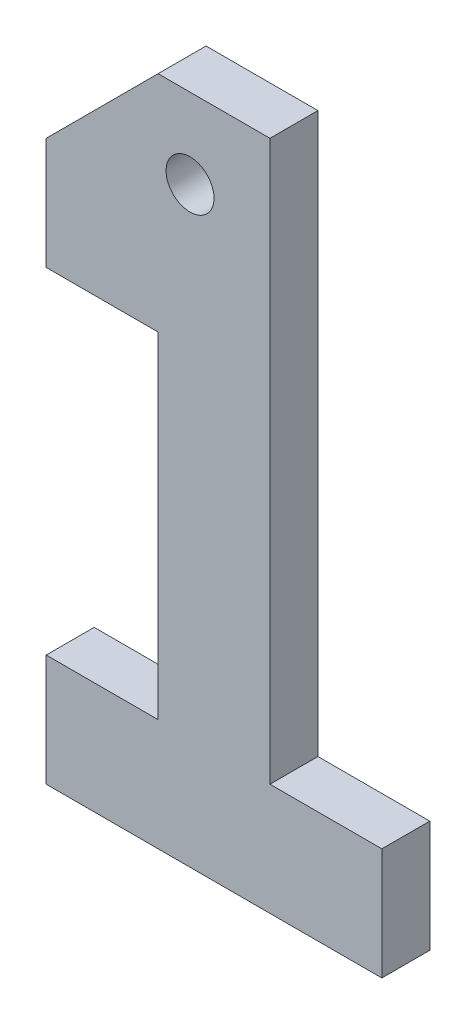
from build123d import *

# Parameters (mm, degrees)
SKETCH3_R      = 3
EXTRUDE1_DEPTH = 6


with BuildPart() as part:
    # Sketch3 → Extrude1 (new body)
    with BuildSketch(Plane.XY):
        Polygon((0, 0), (42, 0), (42, 14), (28, 14), (28, 84), (14, 84), (0, 70), (0, 56), (14, 56), (14, 14), (0, 14), align=None)
        with Locations((18, 74)):
            Circle(SKETCH3_R, mode=Mode.SUBTRACT)
    extrude(amount=EXTRUDE1_DEPTH)


solid = part.part
